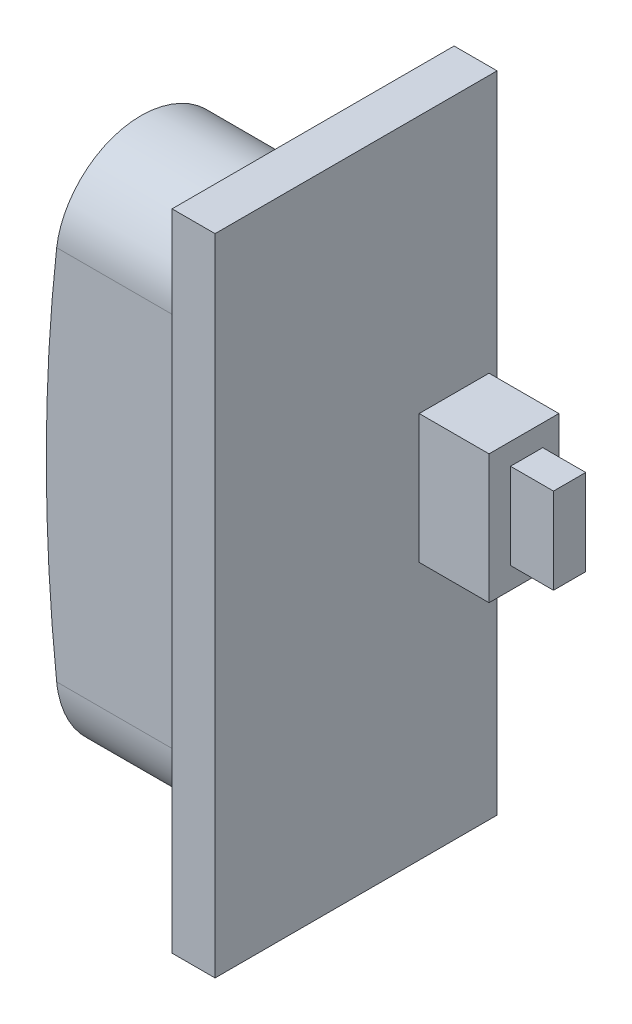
ISO-10303-21;
HEADER;
FILE_DESCRIPTION(('STEP AP214'),'2;1');
FILE_NAME('part.step','',(''),(''),'','','');
FILE_SCHEMA(('AUTOMOTIVE_DESIGN { 1 0 10303 214 1 1 1 1 }'));
ENDSEC;
DATA;
#1=APPLICATION_CONTEXT('core data for automotive mechanical design processes');
#2=APPLICATION_PROTOCOL_DEFINITION('international standard','automotive_design',2000,#1);
#3=PRODUCT_CONTEXT('',#1,'mechanical');
#4=PRODUCT('Part','Part','',(#3));
#5=PRODUCT_RELATED_PRODUCT_CATEGORY('part','',(#4));
#6=PRODUCT_DEFINITION_FORMATION('','',#4);
#7=PRODUCT_DEFINITION_CONTEXT('part definition',#1,'design');
#8=PRODUCT_DEFINITION('design','',#6,#7);
#9=PRODUCT_DEFINITION_SHAPE('','',#8);
#10=(LENGTH_UNIT() NAMED_UNIT(*) SI_UNIT(.MILLI.,.METRE.));
#11=(NAMED_UNIT(*) PLANE_ANGLE_UNIT() SI_UNIT($,.RADIAN.));
#12=(NAMED_UNIT(*) SI_UNIT($,.STERADIAN.) SOLID_ANGLE_UNIT());
#13=UNCERTAINTY_MEASURE_WITH_UNIT(LENGTH_MEASURE(1.E-05),#10,'distance_accuracy_value','');
#14=(GEOMETRIC_REPRESENTATION_CONTEXT(3) GLOBAL_UNCERTAINTY_ASSIGNED_CONTEXT((#13)) GLOBAL_UNIT_ASSIGNED_CONTEXT((#10,
#11,#12)) REPRESENTATION_CONTEXT('',''));
#15=CARTESIAN_POINT('',(0.,0.,0.));
#16=DIRECTION('',(0.,0.,1.));
#17=DIRECTION('',(1.,0.,0.));
#18=AXIS2_PLACEMENT_3D('',#15,#16,#17);
#19=CARTESIAN_POINT('',(-28.2,-3.5,5.));
#20=DIRECTION('',(0.,0.,1.));
#21=DIRECTION('',(1.,0.,0.));
#22=AXIS2_PLACEMENT_3D('',#19,#20,#21);
#23=PLANE('',#22);
#24=CARTESIAN_POINT('',(0.,0.,5.));
#25=DIRECTION('',(0.,0.,1.));
#26=DIRECTION('',(1.,0.,0.));
#27=AXIS2_PLACEMENT_3D('',#24,#25,#26);
#28=CIRCLE('',#27,31.5646052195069);
#29=CARTESIAN_POINT('',(-31.3699586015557,3.5,5.));
#30=VERTEX_POINT('',#29);
#31=CARTESIAN_POINT('',(-31.3699586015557,-3.5,5.));
#32=VERTEX_POINT('',#31);
#33=EDGE_CURVE('E62',#30,#32,#28,.T.);
#34=ORIENTED_EDGE('',*,*,#33,.F.);
#35=DIRECTION('',(-1.,0.,0.));
#36=VECTOR('',#35,1.);
#37=CARTESIAN_POINT('',(-28.2,3.5,5.));
#38=LINE('',#37,#36);
#39=CARTESIAN_POINT('',(-28.6,3.5,5.));
#40=VERTEX_POINT('',#39);
#41=EDGE_CURVE('E178',#40,#30,#38,.T.);
#42=ORIENTED_EDGE('',*,*,#41,.F.);
#43=DIRECTION('',(0.,-1.,0.));
#44=VECTOR('',#43,1.);
#45=CARTESIAN_POINT('',(-28.6,-6.,5.));
#46=LINE('',#45,#44);
#47=CARTESIAN_POINT('',(-28.6,-3.5,4.99999999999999));
#48=VERTEX_POINT('',#47);
#49=EDGE_CURVE('E54',#40,#48,#46,.T.);
#50=ORIENTED_EDGE('',*,*,#49,.T.);
#51=DIRECTION('',(-1.,0.,0.));
#52=VECTOR('',#51,1.);
#53=CARTESIAN_POINT('',(-28.2,-3.5,5.));
#54=LINE('',#53,#52);
#55=EDGE_CURVE('E186',#48,#32,#54,.T.);
#56=ORIENTED_EDGE('',*,*,#55,.T.);
#57=EDGE_LOOP('',(#34,#42,#50,#56));
#58=FACE_BOUND('',#57,.T.);
#59=ADVANCED_FACE('F41',(#58),#23,.F.);
#60=CARTESIAN_POINT('',(-28.2,3.5,6.5));
#61=DIRECTION('',(-1.,0.,0.));
#62=DIRECTION('',(0.,0.,1.));
#63=AXIS2_PLACEMENT_3D('',#60,#61,#62);
#64=CYLINDRICAL_SURFACE('',#63,1.5);
#65=CARTESIAN_POINT('',(-31.5482270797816,3.4998,7.99999998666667));
#66=CARTESIAN_POINT('',(-31.5435475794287,3.54196459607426,8.00000526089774));
#67=CARTESIAN_POINT('',(-31.5389950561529,3.58412359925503,7.99823221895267));
#68=CARTESIAN_POINT('',(-31.5301610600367,3.66816991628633,7.99114028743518));
#69=CARTESIAN_POINT('',(-31.5258795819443,3.710057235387,7.9858214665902));
#70=CARTESIAN_POINT('',(-31.5134796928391,3.83479664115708,7.964583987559));
#71=CARTESIAN_POINT('',(-31.5057914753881,3.91685614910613,7.94338424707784));
#72=CARTESIAN_POINT('',(-31.4915827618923,4.07633845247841,7.88743974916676));
#73=CARTESIAN_POINT('',(-31.4850629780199,4.15375840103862,7.85268677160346));
#74=CARTESIAN_POINT('',(-31.4730325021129,4.30169221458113,7.77060572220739));
#75=CARTESIAN_POINT('',(-31.4675215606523,4.37220778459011,7.72328076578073));
#76=CARTESIAN_POINT('',(-31.457249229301,4.504114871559,7.61753390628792));
#77=CARTESIAN_POINT('',(-31.4524859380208,4.56552951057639,7.55914101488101));
#78=CARTESIAN_POINT('',(-31.4433649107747,4.67769116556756,7.43283313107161));
#79=CARTESIAN_POINT('',(-31.4390072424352,4.72843640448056,7.36491655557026));
#80=CARTESIAN_POINT('',(-31.4303812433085,4.81777100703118,7.22153477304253));
#81=CARTESIAN_POINT('',(-31.4261128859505,4.85636403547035,7.14607185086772));
#82=CARTESIAN_POINT('',(-31.4174114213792,4.9203099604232,6.98974570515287));
#83=CARTESIAN_POINT('',(-31.4129783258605,4.94566379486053,6.90888286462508));
#84=CARTESIAN_POINT('',(-31.4038066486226,4.98241917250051,6.74405674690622));
#85=CARTESIAN_POINT('',(-31.3990680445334,4.99381969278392,6.66009324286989));
#86=CARTESIAN_POINT('',(-31.3892903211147,5.00234982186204,6.49145951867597));
#87=CARTESIAN_POINT('',(-31.384251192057,4.99947896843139,6.40678927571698));
#88=CARTESIAN_POINT('',(-31.3740339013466,4.97954915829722,6.23910421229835));
#89=CARTESIAN_POINT('',(-31.368855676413,4.96248363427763,6.15609017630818));
#90=CARTESIAN_POINT('',(-31.3586802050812,4.9146371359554,5.99410039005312));
#91=CARTESIAN_POINT('',(-31.3536829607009,4.88385600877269,5.91512468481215));
#92=CARTESIAN_POINT('',(-31.3443156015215,4.80942083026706,5.76341405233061));
#93=CARTESIAN_POINT('',(-31.3399457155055,4.7657621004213,5.69068140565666));
#94=CARTESIAN_POINT('',(-31.3323724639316,4.66679260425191,5.55356302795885));
#95=CARTESIAN_POINT('',(-31.3291690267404,4.61148255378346,5.48917678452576));
#96=CARTESIAN_POINT('',(-31.3245064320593,4.49105418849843,5.37088410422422));
#97=CARTESIAN_POINT('',(-31.3230391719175,4.42598304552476,5.31692997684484));
#98=CARTESIAN_POINT('',(-31.3223408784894,4.2876822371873,5.22068270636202));
#99=CARTESIAN_POINT('',(-31.3231102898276,4.21445095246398,5.17839188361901));
#100=CARTESIAN_POINT('',(-31.3272633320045,4.06275261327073,5.1070636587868));
#101=CARTESIAN_POINT('',(-31.33062145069,3.98434344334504,5.07790129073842));
#102=CARTESIAN_POINT('',(-31.3401275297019,3.8239880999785,5.03305039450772));
#103=CARTESIAN_POINT('',(-31.3462714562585,3.74204719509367,5.01734247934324));
#104=CARTESIAN_POINT('',(-31.3562038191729,3.63301705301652,5.00566866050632));
#105=CARTESIAN_POINT('',(-31.3587683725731,3.60637368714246,5.00353747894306));
#106=CARTESIAN_POINT('',(-31.3641707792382,3.55308549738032,5.00070338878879));
#107=CARTESIAN_POINT('',(-31.3670081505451,3.52644075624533,4.99999800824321));
#108=CARTESIAN_POINT('',(-31.3699809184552,3.49980000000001,5.00000001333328));
#109=B_SPLINE_CURVE_WITH_KNOTS('',3,(#65,#66,#67,#68,#69,#70,#71,#72,#73,#74,#75,#76,#77,#78,
#79,#80,#81,#82,#83,#84,#85,#86,#87,#88,#89,#90,#91,#92,#93,#94,#95,#96,#97,#98,#99,#100,#101,
#102,#103,#104,#105,#106,#107,#108),.UNSPECIFIED.,.F.,.F.,(4,2,2,2,2,2,2,2,2,2,2,2,2,2,2,2,2,2,
2,2,2,4),(0.,0.127193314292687,0.254384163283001,0.508378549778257,0.762527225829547,
1.01661298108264,1.2700417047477,1.52351260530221,1.77690699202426,2.03028342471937,
2.28367843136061,2.53708164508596,2.79060216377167,3.04412550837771,3.29774107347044,
3.55134106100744,3.8037527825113,4.05621468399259,4.30621984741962,4.55586416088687,
4.63639005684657,4.71677622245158),.UNSPECIFIED.);
#110=CARTESIAN_POINT('',(-31.5482048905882,3.5,8.));
#111=VERTEX_POINT('',#110);
#112=EDGE_CURVE('E175',#111,#30,#109,.T.);
#113=ORIENTED_EDGE('',*,*,#112,.F.);
#114=DIRECTION('',(-1.,0.,0.));
#115=VECTOR('',#114,1.);
#116=CARTESIAN_POINT('',(-28.2,3.5,8.));
#117=LINE('',#116,#115);
#118=CARTESIAN_POINT('',(-28.6,3.5,8.));
#119=VERTEX_POINT('',#118);
#120=EDGE_CURVE('E174',#119,#111,#117,.T.);
#121=ORIENTED_EDGE('',*,*,#120,.F.);
#122=CARTESIAN_POINT('',(-28.6,3.5,6.5));
#123=DIRECTION('',(1.,0.,0.));
#124=DIRECTION('',(0.,0.,-1.));
#125=AXIS2_PLACEMENT_3D('',#122,#123,#124);
#126=CIRCLE('',#125,1.5);
#127=EDGE_CURVE('E221',#119,#40,#126,.F.);
#128=ORIENTED_EDGE('',*,*,#127,.T.);
#129=ORIENTED_EDGE('',*,*,#41,.T.);
#130=EDGE_LOOP('',(#113,#121,#128,#129));
#131=FACE_BOUND('',#130,.T.);
#132=ADVANCED_FACE('F234',(#131),#64,.T.);
#133=CARTESIAN_POINT('',(-28.2,3.5,8.));
#134=DIRECTION('',(0.,0.,-1.));
#135=DIRECTION('',(-1.,0.,0.));
#136=AXIS2_PLACEMENT_3D('',#133,#134,#135);
#137=PLANE('',#136);
#138=CARTESIAN_POINT('',(0.,0.,8.));
#139=DIRECTION('',(0.,0.,-1.));
#140=DIRECTION('',(-1.,0.,0.));
#141=AXIS2_PLACEMENT_3D('',#138,#139,#140);
#142=CIRCLE('',#141,31.741758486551);
#143=CARTESIAN_POINT('',(-31.5482048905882,-3.5,8.));
#144=VERTEX_POINT('',#143);
#145=EDGE_CURVE('E157',#144,#111,#142,.T.);
#146=ORIENTED_EDGE('',*,*,#145,.F.);
#147=DIRECTION('',(-1.,0.,0.));
#148=VECTOR('',#147,1.);
#149=CARTESIAN_POINT('',(-28.2,-3.5,8.));
#150=LINE('',#149,#148);
#151=CARTESIAN_POINT('',(-28.6,-3.5,8.));
#152=VERTEX_POINT('',#151);
#153=EDGE_CURVE('E168',#152,#144,#150,.T.);
#154=ORIENTED_EDGE('',*,*,#153,.F.);
#155=DIRECTION('',(0.,1.,0.));
#156=VECTOR('',#155,1.);
#157=CARTESIAN_POINT('',(-28.6,-6.,8.));
#158=LINE('',#157,#156);
#159=EDGE_CURVE('E225',#152,#119,#158,.T.);
#160=ORIENTED_EDGE('',*,*,#159,.T.);
#161=ORIENTED_EDGE('',*,*,#120,.T.);
#162=EDGE_LOOP('',(#146,#154,#160,#161));
#163=FACE_BOUND('',#162,.T.);
#164=ADVANCED_FACE('F169',(#163),#137,.F.);
#165=CARTESIAN_POINT('',(-28.2,-3.5,6.5));
#166=DIRECTION('',(-1.,0.,0.));
#167=DIRECTION('',(0.,0.,1.));
#168=AXIS2_PLACEMENT_3D('',#165,#166,#167);
#169=CYLINDRICAL_SURFACE('',#168,1.5);
#170=CARTESIAN_POINT('',(-31.3699809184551,-3.4998,5.00000001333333));
#171=CARTESIAN_POINT('',(-31.3653641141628,-3.5411582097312,4.99999454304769));
#172=CARTESIAN_POINT('',(-31.3610763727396,-3.58253452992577,5.00170066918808));
#173=CARTESIAN_POINT('',(-31.3531766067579,-3.66506819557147,5.00853464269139));
#174=CARTESIAN_POINT('',(-31.3495645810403,-3.70622554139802,5.01366248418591));
#175=CARTESIAN_POINT('',(-31.3397797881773,-3.82884435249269,5.03415262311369));
#176=CARTESIAN_POINT('',(-31.3346421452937,-3.90959806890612,5.05462154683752));
#177=CARTESIAN_POINT('',(-31.3270915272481,-4.06673298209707,5.10869417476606));
#178=CARTESIAN_POINT('',(-31.3246804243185,-4.14311114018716,5.14230688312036));
#179=CARTESIAN_POINT('',(-31.3223101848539,-4.28926634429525,5.22173129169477));
#180=CARTESIAN_POINT('',(-31.3223505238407,-4.3590447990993,5.26754038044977));
#181=CARTESIAN_POINT('',(-31.3244505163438,-4.48996091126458,5.37000795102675));
#182=CARTESIAN_POINT('',(-31.3265081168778,-4.55110728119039,5.42665535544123));
#183=CARTESIAN_POINT('',(-31.3321214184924,-4.6631734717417,5.5492496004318));
#184=CARTESIAN_POINT('',(-31.3356774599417,-4.71409096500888,5.6151985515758));
#185=CARTESIAN_POINT('',(-31.3437923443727,-4.80474477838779,5.75524103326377));
#186=CARTESIAN_POINT('',(-31.348360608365,-4.84436747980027,5.82940757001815));
#187=CARTESIAN_POINT('',(-31.3579761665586,-4.91067962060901,5.98327803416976));
#188=CARTESIAN_POINT('',(-31.363023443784,-4.93736951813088,6.06298176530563));
#189=CARTESIAN_POINT('',(-31.3732315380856,-4.97723563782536,6.22633042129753));
#190=CARTESIAN_POINT('',(-31.3783929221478,-4.99030924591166,6.31000037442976));
#191=CARTESIAN_POINT('',(-31.388516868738,-5.00221634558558,6.47836176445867));
#192=CARTESIAN_POINT('',(-31.3934794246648,-5.00104936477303,6.56305323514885));
#193=CARTESIAN_POINT('',(-31.4030923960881,-4.98449020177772,6.73114653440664));
#194=CARTESIAN_POINT('',(-31.4077424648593,-4.96908248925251,6.81454685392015));
#195=CARTESIAN_POINT('',(-31.4167629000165,-4.92445081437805,6.97758004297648));
#196=CARTESIAN_POINT('',(-31.4211332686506,-4.89522696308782,7.05721294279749));
#197=CARTESIAN_POINT('',(-31.4297678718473,-4.82382022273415,7.21037626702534));
#198=CARTESIAN_POINT('',(-31.4340321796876,-4.78164656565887,7.28391099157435));
#199=CARTESIAN_POINT('',(-31.4427348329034,-4.68554294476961,7.42283325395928));
#200=CARTESIAN_POINT('',(-31.4471731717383,-4.63161342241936,7.48822109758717));
#201=CARTESIAN_POINT('',(-31.4565495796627,-4.51356369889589,7.60897110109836));
#202=CARTESIAN_POINT('',(-31.4614875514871,-4.44944547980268,7.6643352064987));
#203=CARTESIAN_POINT('',(-31.4721819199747,-4.31284269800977,7.76349105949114));
#204=CARTESIAN_POINT('',(-31.4779385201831,-4.24035605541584,7.80727992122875));
#205=CARTESIAN_POINT('',(-31.4905135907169,-4.08911909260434,7.8820500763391));
#206=CARTESIAN_POINT('',(-31.4973324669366,-4.01036638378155,7.91302645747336));
#207=CARTESIAN_POINT('',(-31.5121471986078,-3.8489332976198,7.96127417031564));
#208=CARTESIAN_POINT('',(-31.5201415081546,-3.76625817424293,7.97856331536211));
#209=CARTESIAN_POINT('',(-31.5318056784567,-3.65246872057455,7.99254722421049));
#210=CARTESIAN_POINT('',(-31.5349966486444,-3.62196289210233,7.99534767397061));
#211=CARTESIAN_POINT('',(-31.541512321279,-3.56090661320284,7.99907359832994));
#212=CARTESIAN_POINT('',(-31.5448367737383,-3.53035634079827,8.00000242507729));
#213=CARTESIAN_POINT('',(-31.5482270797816,-3.4998,7.99999998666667));
#214=B_SPLINE_CURVE_WITH_KNOTS('',3,(#170,#171,#172,#173,#174,#175,#176,#177,#178,#179,#180,
#181,#182,#183,#184,#185,#186,#187,#188,#189,#190,#191,#192,#193,#194,#195,#196,#197,#198,#199,
#200,#201,#202,#203,#204,#205,#206,#207,#208,#209,#210,#211,#212,#213),.UNSPECIFIED.,.F.,.F.,(4,
2,2,2,2,2,2,2,2,2,2,2,2,2,2,2,2,2,2,2,2,4),(0.,0.124770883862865,0.249541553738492,
0.498649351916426,0.747928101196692,0.997153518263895,1.24612555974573,1.49515418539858,
1.74660596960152,1.99804884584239,2.25137321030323,2.50470597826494,2.75831534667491,
3.01192267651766,3.26534962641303,3.51876706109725,3.77213525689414,4.02556656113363,
4.27909493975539,4.5322928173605,4.62464880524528,4.71683923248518),.UNSPECIFIED.);
#215=EDGE_CURVE('E11',#32,#144,#214,.T.);
#216=ORIENTED_EDGE('',*,*,#215,.F.);
#217=ORIENTED_EDGE('',*,*,#55,.F.);
#218=CARTESIAN_POINT('',(-28.6,-3.5,6.5));
#219=DIRECTION('',(1.,0.,0.));
#220=DIRECTION('',(0.,0.,-1.));
#221=AXIS2_PLACEMENT_3D('',#218,#219,#220);
#222=CIRCLE('',#221,1.5);
#223=EDGE_CURVE('E179',#48,#152,#222,.F.);
#224=ORIENTED_EDGE('',*,*,#223,.T.);
#225=ORIENTED_EDGE('',*,*,#153,.T.);
#226=EDGE_LOOP('',(#216,#217,#224,#225));
#227=FACE_BOUND('',#226,.T.);
#228=ADVANCED_FACE('F177',(#227),#169,.T.);
#229=CARTESIAN_POINT('',(-28.6,-6.,8.8));
#230=DIRECTION('',(1.,0.,0.));
#231=DIRECTION('',(0.,0.,-1.));
#232=AXIS2_PLACEMENT_3D('',#229,#230,#231);
#233=PLANE('',#232);
#234=ORIENTED_EDGE('',*,*,#49,.F.);
#235=ORIENTED_EDGE('',*,*,#127,.F.);
#236=ORIENTED_EDGE('',*,*,#159,.F.);
#237=ORIENTED_EDGE('',*,*,#223,.F.);
#238=EDGE_LOOP('',(#234,#235,#236,#237));
#239=FACE_BOUND('',#238,.T.);
#240=DIRECTION('',(0.,-1.,0.));
#241=VECTOR('',#240,1.);
#242=CARTESIAN_POINT('',(-28.6,-6.,3.55));
#243=LINE('',#242,#241);
#244=CARTESIAN_POINT('',(-28.6,6.,3.55));
#245=VERTEX_POINT('',#244);
#246=CARTESIAN_POINT('',(-28.6,-6.,3.55));
#247=VERTEX_POINT('',#246);
#248=EDGE_CURVE('E192',#245,#247,#243,.T.);
#249=ORIENTED_EDGE('',*,*,#248,.T.);
#250=DIRECTION('',(0.,0.,-1.));
#251=VECTOR('',#250,1.);
#252=CARTESIAN_POINT('',(-28.6,-6.,8.8));
#253=LINE('',#252,#251);
#254=CARTESIAN_POINT('',(-28.6,-6.,8.8));
#255=VERTEX_POINT('',#254);
#256=EDGE_CURVE('E217',#255,#247,#253,.T.);
#257=ORIENTED_EDGE('',*,*,#256,.F.);
#258=DIRECTION('',(0.,-1.,0.));
#259=VECTOR('',#258,1.);
#260=CARTESIAN_POINT('',(-28.6,-6.,8.8));
#261=LINE('',#260,#259);
#262=CARTESIAN_POINT('',(-28.6,6.,8.8));
#263=VERTEX_POINT('',#262);
#264=EDGE_CURVE('E194',#263,#255,#261,.T.);
#265=ORIENTED_EDGE('',*,*,#264,.F.);
#266=DIRECTION('',(0.,0.,-1.));
#267=VECTOR('',#266,1.);
#268=CARTESIAN_POINT('',(-28.6,6.,8.8));
#269=LINE('',#268,#267);
#270=EDGE_CURVE('E205',#263,#245,#269,.T.);
#271=ORIENTED_EDGE('',*,*,#270,.T.);
#272=EDGE_LOOP('',(#249,#257,#265,#271));
#273=FACE_BOUND('',#272,.T.);
#274=ADVANCED_FACE('F43',(#239,#273),#233,.F.);
#275=CARTESIAN_POINT('',(-28.6,-6.,8.8));
#276=DIRECTION('',(0.,1.,0.));
#277=DIRECTION('',(0.,0.,1.));
#278=AXIS2_PLACEMENT_3D('',#275,#276,#277);
#279=PLANE('',#278);
#280=DIRECTION('',(1.,0.,0.));
#281=VECTOR('',#280,1.);
#282=CARTESIAN_POINT('',(-28.6,-6.,3.55));
#283=LINE('',#282,#281);
#284=CARTESIAN_POINT('',(-27.8,-6.,3.55));
#285=VERTEX_POINT('',#284);
#286=EDGE_CURVE('E202',#247,#285,#283,.T.);
#287=ORIENTED_EDGE('',*,*,#286,.T.);
#288=DIRECTION('',(0.,0.,-1.));
#289=VECTOR('',#288,1.);
#290=CARTESIAN_POINT('',(-27.8,-6.,8.8));
#291=LINE('',#290,#289);
#292=CARTESIAN_POINT('',(-27.8,-6.,8.8));
#293=VERTEX_POINT('',#292);
#294=EDGE_CURVE('E214',#293,#285,#291,.T.);
#295=ORIENTED_EDGE('',*,*,#294,.F.);
#296=DIRECTION('',(1.,0.,0.));
#297=VECTOR('',#296,1.);
#298=CARTESIAN_POINT('',(-28.6,-6.,8.8));
#299=LINE('',#298,#297);
#300=EDGE_CURVE('E193',#255,#293,#299,.T.);
#301=ORIENTED_EDGE('',*,*,#300,.F.);
#302=ORIENTED_EDGE('',*,*,#256,.T.);
#303=EDGE_LOOP('',(#287,#295,#301,#302));
#304=FACE_BOUND('',#303,.T.);
#305=ADVANCED_FACE('F309',(#304),#279,.F.);
#306=CARTESIAN_POINT('',(-27.8,-6.,8.8));
#307=DIRECTION('',(-1.,0.,0.));
#308=DIRECTION('',(0.,0.,1.));
#309=AXIS2_PLACEMENT_3D('',#306,#307,#308);
#310=PLANE('',#309);
#311=DIRECTION('',(0.,0.,-1.));
#312=VECTOR('',#311,1.);
#313=CARTESIAN_POINT('',(-27.8,1.2,5.));
#314=LINE('',#313,#312);
#315=CARTESIAN_POINT('',(-27.8,1.2,5.));
#316=VERTEX_POINT('',#315);
#317=CARTESIAN_POINT('',(-27.8,1.2,3.7));
#318=VERTEX_POINT('',#317);
#319=EDGE_CURVE('E456',#316,#318,#314,.T.);
#320=ORIENTED_EDGE('',*,*,#319,.T.);
#321=DIRECTION('',(0.,-1.,0.));
#322=VECTOR('',#321,1.);
#323=CARTESIAN_POINT('',(-27.8,-1.2,3.7));
#324=LINE('',#323,#322);
#325=CARTESIAN_POINT('',(-27.8,-1.2,3.7));
#326=VERTEX_POINT('',#325);
#327=EDGE_CURVE('E458',#318,#326,#324,.T.);
#328=ORIENTED_EDGE('',*,*,#327,.T.);
#329=DIRECTION('',(0.,0.,-1.));
#330=VECTOR('',#329,1.);
#331=CARTESIAN_POINT('',(-27.8,-1.2,5.));
#332=LINE('',#331,#330);
#333=CARTESIAN_POINT('',(-27.8,-1.2,5.));
#334=VERTEX_POINT('',#333);
#335=EDGE_CURVE('E180',#334,#326,#332,.T.);
#336=ORIENTED_EDGE('',*,*,#335,.F.);
#337=DIRECTION('',(0.,-1.,0.));
#338=VECTOR('',#337,1.);
#339=CARTESIAN_POINT('',(-27.8,-1.2,5.));
#340=LINE('',#339,#338);
#341=EDGE_CURVE('E464',#316,#334,#340,.T.);
#342=ORIENTED_EDGE('',*,*,#341,.F.);
#343=EDGE_LOOP('',(#320,#328,#336,#342));
#344=FACE_BOUND('',#343,.T.);
#345=DIRECTION('',(0.,1.,0.));
#346=VECTOR('',#345,1.);
#347=CARTESIAN_POINT('',(-27.8,-6.,3.55));
#348=LINE('',#347,#346);
#349=CARTESIAN_POINT('',(-27.8,6.,3.55));
#350=VERTEX_POINT('',#349);
#351=EDGE_CURVE('E210',#285,#350,#348,.T.);
#352=ORIENTED_EDGE('',*,*,#351,.T.);
#353=DIRECTION('',(0.,0.,-1.));
#354=VECTOR('',#353,1.);
#355=CARTESIAN_POINT('',(-27.8,6.,8.8));
#356=LINE('',#355,#354);
#357=CARTESIAN_POINT('',(-27.8,6.,8.8));
#358=VERTEX_POINT('',#357);
#359=EDGE_CURVE('E215',#358,#350,#356,.T.);
#360=ORIENTED_EDGE('',*,*,#359,.F.);
#361=DIRECTION('',(0.,1.,0.));
#362=VECTOR('',#361,1.);
#363=CARTESIAN_POINT('',(-27.8,-6.,8.8));
#364=LINE('',#363,#362);
#365=EDGE_CURVE('E196',#293,#358,#364,.T.);
#366=ORIENTED_EDGE('',*,*,#365,.F.);
#367=ORIENTED_EDGE('',*,*,#294,.T.);
#368=EDGE_LOOP('',(#352,#360,#366,#367));
#369=FACE_BOUND('',#368,.T.);
#370=ADVANCED_FACE('F307',(#344,#369),#310,.F.);
#371=CARTESIAN_POINT('',(-28.6,6.,8.8));
#372=DIRECTION('',(0.,-1.,0.));
#373=DIRECTION('',(0.,0.,-1.));
#374=AXIS2_PLACEMENT_3D('',#371,#372,#373);
#375=PLANE('',#374);
#376=DIRECTION('',(-1.,0.,0.));
#377=VECTOR('',#376,1.);
#378=CARTESIAN_POINT('',(-28.6,6.,3.55));
#379=LINE('',#378,#377);
#380=EDGE_CURVE('E198',#350,#245,#379,.T.);
#381=ORIENTED_EDGE('',*,*,#380,.T.);
#382=ORIENTED_EDGE('',*,*,#270,.F.);
#383=DIRECTION('',(-1.,0.,0.));
#384=VECTOR('',#383,1.);
#385=CARTESIAN_POINT('',(-28.6,6.,8.8));
#386=LINE('',#385,#384);
#387=EDGE_CURVE('E199',#358,#263,#386,.T.);
#388=ORIENTED_EDGE('',*,*,#387,.F.);
#389=ORIENTED_EDGE('',*,*,#359,.T.);
#390=EDGE_LOOP('',(#381,#382,#388,#389));
#391=FACE_BOUND('',#390,.T.);
#392=ADVANCED_FACE('F298',(#391),#375,.F.);
#393=CARTESIAN_POINT('',(0.,0.,8.8));
#394=DIRECTION('',(0.,0.,-1.));
#395=DIRECTION('',(-1.,0.,0.));
#396=AXIS2_PLACEMENT_3D('',#393,#394,#395);
#397=PLANE('',#396);
#398=ORIENTED_EDGE('',*,*,#264,.T.);
#399=ORIENTED_EDGE('',*,*,#300,.T.);
#400=ORIENTED_EDGE('',*,*,#365,.T.);
#401=ORIENTED_EDGE('',*,*,#387,.T.);
#402=EDGE_LOOP('',(#398,#399,#400,#401));
#403=FACE_BOUND('',#402,.T.);
#404=ADVANCED_FACE('F299',(#403),#397,.F.);
#405=CARTESIAN_POINT('',(0.,0.,3.55));
#406=DIRECTION('',(0.,0.,-1.));
#407=DIRECTION('',(-1.,0.,0.));
#408=AXIS2_PLACEMENT_3D('',#405,#406,#407);
#409=PLANE('',#408);
#410=ORIENTED_EDGE('',*,*,#248,.F.);
#411=ORIENTED_EDGE('',*,*,#380,.F.);
#412=ORIENTED_EDGE('',*,*,#351,.F.);
#413=ORIENTED_EDGE('',*,*,#286,.F.);
#414=EDGE_LOOP('',(#410,#411,#412,#413));
#415=FACE_BOUND('',#414,.T.);
#416=ADVANCED_FACE('F283',(#415),#409,.T.);
#417=CARTESIAN_POINT('',(-27.8,-1.2,5.));
#418=DIRECTION('',(0.,1.,0.));
#419=DIRECTION('',(0.,0.,1.));
#420=AXIS2_PLACEMENT_3D('',#417,#418,#419);
#421=PLANE('',#420);
#422=DIRECTION('',(1.,0.,0.));
#423=VECTOR('',#422,1.);
#424=CARTESIAN_POINT('',(-27.8,-1.2,3.7));
#425=LINE('',#424,#423);
#426=CARTESIAN_POINT('',(-26.5,-1.2,3.7));
#427=VERTEX_POINT('',#426);
#428=EDGE_CURVE('E483',#326,#427,#425,.T.);
#429=ORIENTED_EDGE('',*,*,#428,.T.);
#430=DIRECTION('',(0.,0.,-1.));
#431=VECTOR('',#430,1.);
#432=CARTESIAN_POINT('',(-26.5,-1.2,5.));
#433=LINE('',#432,#431);
#434=CARTESIAN_POINT('',(-26.5,-1.2,5.));
#435=VERTEX_POINT('',#434);
#436=EDGE_CURVE('E181',#435,#427,#433,.T.);
#437=ORIENTED_EDGE('',*,*,#436,.F.);
#438=DIRECTION('',(1.,0.,0.));
#439=VECTOR('',#438,1.);
#440=CARTESIAN_POINT('',(-27.8,-1.2,5.));
#441=LINE('',#440,#439);
#442=EDGE_CURVE('E487',#334,#435,#441,.T.);
#443=ORIENTED_EDGE('',*,*,#442,.F.);
#444=ORIENTED_EDGE('',*,*,#335,.T.);
#445=EDGE_LOOP('',(#429,#437,#443,#444));
#446=FACE_BOUND('',#445,.T.);
#447=ADVANCED_FACE('F284',(#446),#421,.F.);
#448=CARTESIAN_POINT('',(-26.5,-1.2,5.));
#449=DIRECTION('',(-1.,0.,0.));
#450=DIRECTION('',(0.,0.,1.));
#451=AXIS2_PLACEMENT_3D('',#448,#449,#450);
#452=PLANE('',#451);
#453=DIRECTION('',(0.,0.,-1.));
#454=VECTOR('',#453,1.);
#455=CARTESIAN_POINT('',(-26.5,0.8,4.6));
#456=LINE('',#455,#454);
#457=CARTESIAN_POINT('',(-26.5,0.8,4.6));
#458=VERTEX_POINT('',#457);
#459=CARTESIAN_POINT('',(-26.5,0.8,4.));
#460=VERTEX_POINT('',#459);
#461=EDGE_CURVE('E498',#458,#460,#456,.T.);
#462=ORIENTED_EDGE('',*,*,#461,.T.);
#463=DIRECTION('',(0.,-1.,0.));
#464=VECTOR('',#463,1.);
#465=CARTESIAN_POINT('',(-26.5,-0.8,4.));
#466=LINE('',#465,#464);
#467=CARTESIAN_POINT('',(-26.5,-0.8,4.));
#468=VERTEX_POINT('',#467);
#469=EDGE_CURVE('E66',#460,#468,#466,.T.);
#470=ORIENTED_EDGE('',*,*,#469,.T.);
#471=DIRECTION('',(0.,0.,-1.));
#472=VECTOR('',#471,1.);
#473=CARTESIAN_POINT('',(-26.5,-0.8,4.6));
#474=LINE('',#473,#472);
#475=CARTESIAN_POINT('',(-26.5,-0.8,4.6));
#476=VERTEX_POINT('',#475);
#477=EDGE_CURVE('E486',#476,#468,#474,.T.);
#478=ORIENTED_EDGE('',*,*,#477,.F.);
#479=DIRECTION('',(0.,-1.,0.));
#480=VECTOR('',#479,1.);
#481=CARTESIAN_POINT('',(-26.5,-0.8,4.6));
#482=LINE('',#481,#480);
#483=EDGE_CURVE('E507',#458,#476,#482,.T.);
#484=ORIENTED_EDGE('',*,*,#483,.F.);
#485=EDGE_LOOP('',(#462,#470,#478,#484));
#486=FACE_BOUND('',#485,.T.);
#487=DIRECTION('',(0.,1.,0.));
#488=VECTOR('',#487,1.);
#489=CARTESIAN_POINT('',(-26.5,-1.2,3.7));
#490=LINE('',#489,#488);
#491=CARTESIAN_POINT('',(-26.5,1.2,3.7));
#492=VERTEX_POINT('',#491);
#493=EDGE_CURVE('E481',#427,#492,#490,.T.);
#494=ORIENTED_EDGE('',*,*,#493,.T.);
#495=DIRECTION('',(0.,0.,-1.));
#496=VECTOR('',#495,1.);
#497=CARTESIAN_POINT('',(-26.5,1.2,5.));
#498=LINE('',#497,#496);
#499=CARTESIAN_POINT('',(-26.5,1.2,5.));
#500=VERTEX_POINT('',#499);
#501=EDGE_CURVE('E463',#500,#492,#498,.T.);
#502=ORIENTED_EDGE('',*,*,#501,.F.);
#503=DIRECTION('',(0.,1.,0.));
#504=VECTOR('',#503,1.);
#505=CARTESIAN_POINT('',(-26.5,-1.2,5.));
#506=LINE('',#505,#504);
#507=EDGE_CURVE('E468',#435,#500,#506,.T.);
#508=ORIENTED_EDGE('',*,*,#507,.F.);
#509=ORIENTED_EDGE('',*,*,#436,.T.);
#510=EDGE_LOOP('',(#494,#502,#508,#509));
#511=FACE_BOUND('',#510,.T.);
#512=ADVANCED_FACE('F279',(#486,#511),#452,.F.);
#513=CARTESIAN_POINT('',(-27.8,1.2,5.));
#514=DIRECTION('',(0.,-1.,0.));
#515=DIRECTION('',(0.,0.,-1.));
#516=AXIS2_PLACEMENT_3D('',#513,#514,#515);
#517=PLANE('',#516);
#518=DIRECTION('',(-1.,0.,0.));
#519=VECTOR('',#518,1.);
#520=CARTESIAN_POINT('',(-27.8,1.2,3.7));
#521=LINE('',#520,#519);
#522=EDGE_CURVE('E471',#492,#318,#521,.T.);
#523=ORIENTED_EDGE('',*,*,#522,.T.);
#524=ORIENTED_EDGE('',*,*,#319,.F.);
#525=DIRECTION('',(-1.,0.,0.));
#526=VECTOR('',#525,1.);
#527=CARTESIAN_POINT('',(-27.8,1.2,5.));
#528=LINE('',#527,#526);
#529=EDGE_CURVE('E467',#500,#316,#528,.T.);
#530=ORIENTED_EDGE('',*,*,#529,.F.);
#531=ORIENTED_EDGE('',*,*,#501,.T.);
#532=EDGE_LOOP('',(#523,#524,#530,#531));
#533=FACE_BOUND('',#532,.T.);
#534=ADVANCED_FACE('F271',(#533),#517,.F.);
#535=CARTESIAN_POINT('',(0.,0.,5.));
#536=DIRECTION('',(0.,0.,-1.));
#537=DIRECTION('',(-1.,0.,0.));
#538=AXIS2_PLACEMENT_3D('',#535,#536,#537);
#539=PLANE('',#538);
#540=ORIENTED_EDGE('',*,*,#341,.T.);
#541=ORIENTED_EDGE('',*,*,#442,.T.);
#542=ORIENTED_EDGE('',*,*,#507,.T.);
#543=ORIENTED_EDGE('',*,*,#529,.T.);
#544=EDGE_LOOP('',(#540,#541,#542,#543));
#545=FACE_BOUND('',#544,.T.);
#546=ADVANCED_FACE('F268',(#545),#539,.F.);
#547=CARTESIAN_POINT('',(0.,0.,3.7));
#548=DIRECTION('',(0.,0.,-1.));
#549=DIRECTION('',(-1.,0.,0.));
#550=AXIS2_PLACEMENT_3D('',#547,#548,#549);
#551=PLANE('',#550);
#552=ORIENTED_EDGE('',*,*,#327,.F.);
#553=ORIENTED_EDGE('',*,*,#522,.F.);
#554=ORIENTED_EDGE('',*,*,#493,.F.);
#555=ORIENTED_EDGE('',*,*,#428,.F.);
#556=EDGE_LOOP('',(#552,#553,#554,#555));
#557=FACE_BOUND('',#556,.T.);
#558=ADVANCED_FACE('F266',(#557),#551,.T.);
#559=CARTESIAN_POINT('',(-26.5,-0.8,4.6));
#560=DIRECTION('',(0.,1.,0.));
#561=DIRECTION('',(0.,0.,1.));
#562=AXIS2_PLACEMENT_3D('',#559,#560,#561);
#563=PLANE('',#562);
#564=DIRECTION('',(1.,0.,0.));
#565=VECTOR('',#564,1.);
#566=CARTESIAN_POINT('',(-26.5,-0.8,4.));
#567=LINE('',#566,#565);
#568=CARTESIAN_POINT('',(-25.7,-0.8,4.));
#569=VERTEX_POINT('',#568);
#570=EDGE_CURVE('E506',#468,#569,#567,.T.);
#571=ORIENTED_EDGE('',*,*,#570,.T.);
#572=DIRECTION('',(0.,0.,-1.));
#573=VECTOR('',#572,1.);
#574=CARTESIAN_POINT('',(-25.7,-0.8,4.6));
#575=LINE('',#574,#573);
#576=CARTESIAN_POINT('',(-25.7,-0.8,4.6));
#577=VERTEX_POINT('',#576);
#578=EDGE_CURVE('E493',#577,#569,#575,.T.);
#579=ORIENTED_EDGE('',*,*,#578,.F.);
#580=DIRECTION('',(1.,0.,0.));
#581=VECTOR('',#580,1.);
#582=CARTESIAN_POINT('',(-26.5,-0.8,4.6));
#583=LINE('',#582,#581);
#584=EDGE_CURVE('E513',#476,#577,#583,.T.);
#585=ORIENTED_EDGE('',*,*,#584,.F.);
#586=ORIENTED_EDGE('',*,*,#477,.T.);
#587=EDGE_LOOP('',(#571,#579,#585,#586));
#588=FACE_BOUND('',#587,.T.);
#589=ADVANCED_FACE('F265',(#588),#563,.F.);
#590=CARTESIAN_POINT('',(-25.7,-0.8,4.6));
#591=DIRECTION('',(-1.,0.,0.));
#592=DIRECTION('',(0.,0.,1.));
#593=AXIS2_PLACEMENT_3D('',#590,#591,#592);
#594=PLANE('',#593);
#595=DIRECTION('',(0.,1.,0.));
#596=VECTOR('',#595,1.);
#597=CARTESIAN_POINT('',(-25.7,-0.8,4.));
#598=LINE('',#597,#596);
#599=CARTESIAN_POINT('',(-25.7,0.8,4.));
#600=VERTEX_POINT('',#599);
#601=EDGE_CURVE('E509',#569,#600,#598,.T.);
#602=ORIENTED_EDGE('',*,*,#601,.T.);
#603=DIRECTION('',(0.,0.,-1.));
#604=VECTOR('',#603,1.);
#605=CARTESIAN_POINT('',(-25.7,0.8,4.6));
#606=LINE('',#605,#604);
#607=CARTESIAN_POINT('',(-25.7,0.8,4.6));
#608=VERTEX_POINT('',#607);
#609=EDGE_CURVE('E500',#608,#600,#606,.T.);
#610=ORIENTED_EDGE('',*,*,#609,.F.);
#611=DIRECTION('',(0.,1.,0.));
#612=VECTOR('',#611,1.);
#613=CARTESIAN_POINT('',(-25.7,-0.8,4.6));
#614=LINE('',#613,#612);
#615=EDGE_CURVE('E511',#577,#608,#614,.T.);
#616=ORIENTED_EDGE('',*,*,#615,.F.);
#617=ORIENTED_EDGE('',*,*,#578,.T.);
#618=EDGE_LOOP('',(#602,#610,#616,#617));
#619=FACE_BOUND('',#618,.T.);
#620=ADVANCED_FACE('F256',(#619),#594,.F.);
#621=CARTESIAN_POINT('',(-26.5,0.8,4.6));
#622=DIRECTION('',(0.,-1.,0.));
#623=DIRECTION('',(0.,0.,-1.));
#624=AXIS2_PLACEMENT_3D('',#621,#622,#623);
#625=PLANE('',#624);
#626=DIRECTION('',(-1.,0.,0.));
#627=VECTOR('',#626,1.);
#628=CARTESIAN_POINT('',(-26.5,0.8,4.));
#629=LINE('',#628,#627);
#630=EDGE_CURVE('E501',#600,#460,#629,.T.);
#631=ORIENTED_EDGE('',*,*,#630,.T.);
#632=ORIENTED_EDGE('',*,*,#461,.F.);
#633=DIRECTION('',(-1.,0.,0.));
#634=VECTOR('',#633,1.);
#635=CARTESIAN_POINT('',(-26.5,0.8,4.6));
#636=LINE('',#635,#634);
#637=EDGE_CURVE('E505',#608,#458,#636,.T.);
#638=ORIENTED_EDGE('',*,*,#637,.F.);
#639=ORIENTED_EDGE('',*,*,#609,.T.);
#640=EDGE_LOOP('',(#631,#632,#638,#639));
#641=FACE_BOUND('',#640,.T.);
#642=ADVANCED_FACE('F252',(#641),#625,.F.);
#643=CARTESIAN_POINT('',(0.,0.,4.6));
#644=DIRECTION('',(0.,0.,-1.));
#645=DIRECTION('',(-1.,0.,0.));
#646=AXIS2_PLACEMENT_3D('',#643,#644,#645);
#647=PLANE('',#646);
#648=ORIENTED_EDGE('',*,*,#483,.T.);
#649=ORIENTED_EDGE('',*,*,#584,.T.);
#650=ORIENTED_EDGE('',*,*,#615,.T.);
#651=ORIENTED_EDGE('',*,*,#637,.T.);
#652=EDGE_LOOP('',(#648,#649,#650,#651));
#653=FACE_BOUND('',#652,.T.);
#654=ADVANCED_FACE('F250',(#653),#647,.F.);
#655=CARTESIAN_POINT('',(0.,0.,4.));
#656=DIRECTION('',(0.,0.,-1.));
#657=DIRECTION('',(-1.,0.,0.));
#658=AXIS2_PLACEMENT_3D('',#655,#656,#657);
#659=PLANE('',#658);
#660=ORIENTED_EDGE('',*,*,#469,.F.);
#661=ORIENTED_EDGE('',*,*,#630,.F.);
#662=ORIENTED_EDGE('',*,*,#601,.F.);
#663=ORIENTED_EDGE('',*,*,#570,.F.);
#664=EDGE_LOOP('',(#660,#661,#662,#663));
#665=FACE_BOUND('',#664,.T.);
#666=ADVANCED_FACE('F249',(#665),#659,.T.);
#667=CARTESIAN_POINT('',(0.,0.,7.));
#668=DIRECTION('',(0.,0.,-1.));
#669=DIRECTION('',(-1.,0.,0.));
#670=AXIS2_PLACEMENT_3D('',#667,#668,#669);
#671=TOROIDAL_SURFACE('',#670,23.1859375,8.6140625);
#672=ORIENTED_EDGE('',*,*,#33,.T.);
#673=ORIENTED_EDGE('',*,*,#215,.T.);
#674=ORIENTED_EDGE('',*,*,#145,.T.);
#675=ORIENTED_EDGE('',*,*,#112,.T.);
#676=EDGE_LOOP('',(#672,#673,#674,#675));
#677=FACE_BOUND('',#676,.T.);
#678=ADVANCED_FACE('F158',(#677),#671,.T.);
#679=CLOSED_SHELL('',(#59,#132,#164,#228,#274,#305,#370,#392,#404,#416,#447,#512,#534,#546,#558,
#589,#620,#642,#654,#666,#678));
#680=MANIFOLD_SOLID_BREP('B2',#679);
#681=ADVANCED_BREP_SHAPE_REPRESENTATION('',(#18,#680),#14);
#682=SHAPE_DEFINITION_REPRESENTATION(#9,#681);
ENDSEC;
END-ISO-10303-21;
